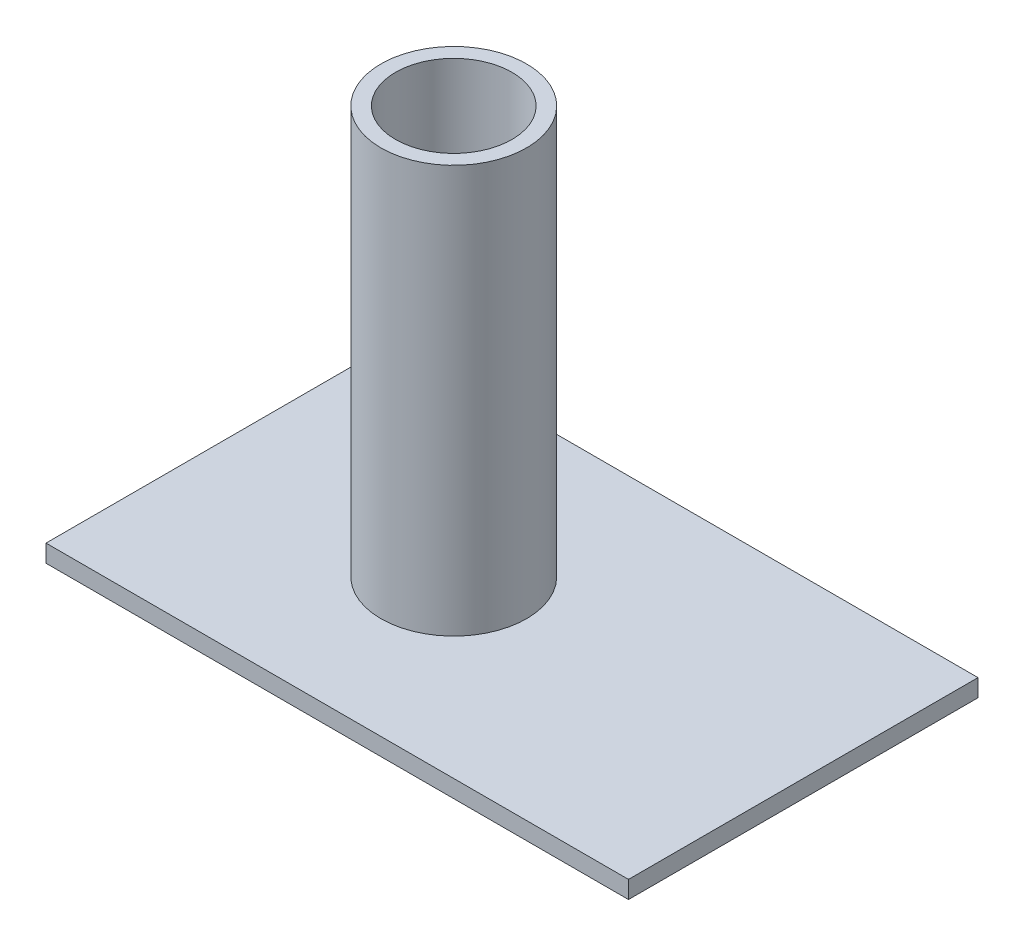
ISO-10303-21;
HEADER;
FILE_DESCRIPTION(('STEP AP214'),'2;1');
FILE_NAME('part.step','',(''),(''),'','','');
FILE_SCHEMA(('AUTOMOTIVE_DESIGN { 1 0 10303 214 1 1 1 1 }'));
ENDSEC;
DATA;
#1=APPLICATION_CONTEXT('core data for automotive mechanical design processes');
#2=APPLICATION_PROTOCOL_DEFINITION('international standard','automotive_design',2000,#1);
#3=PRODUCT_CONTEXT('',#1,'mechanical');
#4=PRODUCT('Part','Part','',(#3));
#5=PRODUCT_RELATED_PRODUCT_CATEGORY('part','',(#4));
#6=PRODUCT_DEFINITION_FORMATION('','',#4);
#7=PRODUCT_DEFINITION_CONTEXT('part definition',#1,'design');
#8=PRODUCT_DEFINITION('design','',#6,#7);
#9=PRODUCT_DEFINITION_SHAPE('','',#8);
#10=(LENGTH_UNIT() NAMED_UNIT(*) SI_UNIT(.MILLI.,.METRE.));
#11=(NAMED_UNIT(*) PLANE_ANGLE_UNIT() SI_UNIT($,.RADIAN.));
#12=(NAMED_UNIT(*) SI_UNIT($,.STERADIAN.) SOLID_ANGLE_UNIT());
#13=UNCERTAINTY_MEASURE_WITH_UNIT(LENGTH_MEASURE(1.E-05),#10,'distance_accuracy_value','');
#14=(GEOMETRIC_REPRESENTATION_CONTEXT(3) GLOBAL_UNCERTAINTY_ASSIGNED_CONTEXT((#13)) GLOBAL_UNIT_ASSIGNED_CONTEXT((#10,
#11,#12)) REPRESENTATION_CONTEXT('',''));
#15=CARTESIAN_POINT('',(0.,0.,0.));
#16=DIRECTION('',(0.,0.,1.));
#17=DIRECTION('',(1.,0.,0.));
#18=AXIS2_PLACEMENT_3D('',#15,#16,#17);
#19=CARTESIAN_POINT('',(0.,0.,0.));
#20=DIRECTION('',(0.,1.,0.));
#21=DIRECTION('',(0.,0.,1.));
#22=AXIS2_PLACEMENT_3D('',#19,#20,#21);
#23=PLANE('',#22);
#24=DIRECTION('',(0.,0.,1.));
#25=VECTOR('',#24,1.);
#26=CARTESIAN_POINT('',(-50.,0.,-30.));
#27=LINE('',#26,#25);
#28=CARTESIAN_POINT('',(-50.,0.,-30.));
#29=VERTEX_POINT('',#28);
#30=CARTESIAN_POINT('',(-50.,0.,30.));
#31=VERTEX_POINT('',#30);
#32=EDGE_CURVE('E102',#29,#31,#27,.T.);
#33=ORIENTED_EDGE('',*,*,#32,.T.);
#34=DIRECTION('',(1.,0.,0.));
#35=VECTOR('',#34,1.);
#36=CARTESIAN_POINT('',(-50.,0.,30.));
#37=LINE('',#36,#35);
#38=CARTESIAN_POINT('',(50.,0.,30.));
#39=VERTEX_POINT('',#38);
#40=EDGE_CURVE('E105',#31,#39,#37,.T.);
#41=ORIENTED_EDGE('',*,*,#40,.T.);
#42=DIRECTION('',(0.,0.,1.));
#43=VECTOR('',#42,1.);
#44=CARTESIAN_POINT('',(50.,0.,-30.));
#45=LINE('',#44,#43);
#46=CARTESIAN_POINT('',(50.,0.,-30.));
#47=VERTEX_POINT('',#46);
#48=EDGE_CURVE('E91',#47,#39,#45,.T.);
#49=ORIENTED_EDGE('',*,*,#48,.F.);
#50=DIRECTION('',(1.,0.,0.));
#51=VECTOR('',#50,1.);
#52=CARTESIAN_POINT('',(-50.,0.,-30.));
#53=LINE('',#52,#51);
#54=EDGE_CURVE('E66',#29,#47,#53,.T.);
#55=ORIENTED_EDGE('',*,*,#54,.F.);
#56=EDGE_LOOP('',(#33,#41,#49,#55));
#57=FACE_BOUND('',#56,.T.);
#58=CARTESIAN_POINT('',(-9.99999999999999,0.,0.));
#59=DIRECTION('',(0.,1.,0.));
#60=DIRECTION('',(0.,0.,1.));
#61=AXIS2_PLACEMENT_3D('',#58,#59,#60);
#62=CIRCLE('',#61,12.5);
#63=CARTESIAN_POINT('',(-9.99999999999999,0.,12.5));
#64=VERTEX_POINT('',#63);
#65=EDGE_CURVE('E118',#64,#64,#62,.T.);
#66=ORIENTED_EDGE('',*,*,#65,.F.);
#67=EDGE_LOOP('',(#66));
#68=FACE_BOUND('',#67,.T.);
#69=ADVANCED_FACE('F33',(#57,#68),#23,.T.);
#70=CARTESIAN_POINT('',(-50.,-3.,-30.));
#71=DIRECTION('',(-1.,0.,0.));
#72=DIRECTION('',(0.,0.,1.));
#73=AXIS2_PLACEMENT_3D('',#70,#71,#72);
#74=PLANE('',#73);
#75=ORIENTED_EDGE('',*,*,#32,.F.);
#76=DIRECTION('',(0.,1.,0.));
#77=VECTOR('',#76,1.);
#78=CARTESIAN_POINT('',(-50.,-3.,-30.));
#79=LINE('',#78,#77);
#80=CARTESIAN_POINT('',(-50.,-3.,-30.));
#81=VERTEX_POINT('',#80);
#82=EDGE_CURVE('E42',#81,#29,#79,.T.);
#83=ORIENTED_EDGE('',*,*,#82,.F.);
#84=DIRECTION('',(0.,0.,1.));
#85=VECTOR('',#84,1.);
#86=CARTESIAN_POINT('',(-50.,-3.,-30.));
#87=LINE('',#86,#85);
#88=CARTESIAN_POINT('',(-50.,-3.,30.));
#89=VERTEX_POINT('',#88);
#90=EDGE_CURVE('E96',#81,#89,#87,.T.);
#91=ORIENTED_EDGE('',*,*,#90,.T.);
#92=DIRECTION('',(0.,1.,0.));
#93=VECTOR('',#92,1.);
#94=CARTESIAN_POINT('',(-50.,-3.,30.));
#95=LINE('',#94,#93);
#96=EDGE_CURVE('E74',#89,#31,#95,.T.);
#97=ORIENTED_EDGE('',*,*,#96,.T.);
#98=EDGE_LOOP('',(#75,#83,#91,#97));
#99=FACE_BOUND('',#98,.T.);
#100=ADVANCED_FACE('F35',(#99),#74,.T.);
#101=CARTESIAN_POINT('',(-50.,-3.,-30.));
#102=DIRECTION('',(0.,0.,1.));
#103=DIRECTION('',(1.,0.,0.));
#104=AXIS2_PLACEMENT_3D('',#101,#102,#103);
#105=PLANE('',#104);
#106=ORIENTED_EDGE('',*,*,#54,.T.);
#107=DIRECTION('',(0.,1.,0.));
#108=VECTOR('',#107,1.);
#109=CARTESIAN_POINT('',(50.,-3.,-30.));
#110=LINE('',#109,#108);
#111=CARTESIAN_POINT('',(50.,-3.,-30.));
#112=VERTEX_POINT('',#111);
#113=EDGE_CURVE('E93',#112,#47,#110,.T.);
#114=ORIENTED_EDGE('',*,*,#113,.F.);
#115=DIRECTION('',(1.,0.,0.));
#116=VECTOR('',#115,1.);
#117=CARTESIAN_POINT('',(-50.,-3.,-30.));
#118=LINE('',#117,#116);
#119=EDGE_CURVE('E84',#81,#112,#118,.T.);
#120=ORIENTED_EDGE('',*,*,#119,.F.);
#121=ORIENTED_EDGE('',*,*,#82,.T.);
#122=EDGE_LOOP('',(#106,#114,#120,#121));
#123=FACE_BOUND('',#122,.T.);
#124=ADVANCED_FACE('F146',(#123),#105,.F.);
#125=CARTESIAN_POINT('',(50.,-3.,-30.));
#126=DIRECTION('',(-1.,0.,0.));
#127=DIRECTION('',(0.,0.,1.));
#128=AXIS2_PLACEMENT_3D('',#125,#126,#127);
#129=PLANE('',#128);
#130=ORIENTED_EDGE('',*,*,#48,.T.);
#131=DIRECTION('',(0.,1.,0.));
#132=VECTOR('',#131,1.);
#133=CARTESIAN_POINT('',(50.,-3.,30.));
#134=LINE('',#133,#132);
#135=CARTESIAN_POINT('',(50.,-3.,30.));
#136=VERTEX_POINT('',#135);
#137=EDGE_CURVE('E88',#136,#39,#134,.T.);
#138=ORIENTED_EDGE('',*,*,#137,.F.);
#139=DIRECTION('',(0.,0.,1.));
#140=VECTOR('',#139,1.);
#141=CARTESIAN_POINT('',(50.,-3.,-30.));
#142=LINE('',#141,#140);
#143=EDGE_CURVE('E79',#112,#136,#142,.T.);
#144=ORIENTED_EDGE('',*,*,#143,.F.);
#145=ORIENTED_EDGE('',*,*,#113,.T.);
#146=EDGE_LOOP('',(#130,#138,#144,#145));
#147=FACE_BOUND('',#146,.T.);
#148=ADVANCED_FACE('F89',(#147),#129,.F.);
#149=CARTESIAN_POINT('',(-50.,-3.,30.));
#150=DIRECTION('',(0.,0.,1.));
#151=DIRECTION('',(1.,0.,0.));
#152=AXIS2_PLACEMENT_3D('',#149,#150,#151);
#153=PLANE('',#152);
#154=ORIENTED_EDGE('',*,*,#40,.F.);
#155=ORIENTED_EDGE('',*,*,#96,.F.);
#156=DIRECTION('',(1.,0.,0.));
#157=VECTOR('',#156,1.);
#158=CARTESIAN_POINT('',(-50.,-3.,30.));
#159=LINE('',#158,#157);
#160=EDGE_CURVE('E83',#89,#136,#159,.T.);
#161=ORIENTED_EDGE('',*,*,#160,.T.);
#162=ORIENTED_EDGE('',*,*,#137,.T.);
#163=EDGE_LOOP('',(#154,#155,#161,#162));
#164=FACE_BOUND('',#163,.T.);
#165=ADVANCED_FACE('F95',(#164),#153,.T.);
#166=CARTESIAN_POINT('',(0.,-3.,0.));
#167=DIRECTION('',(0.,1.,0.));
#168=DIRECTION('',(0.,0.,1.));
#169=AXIS2_PLACEMENT_3D('',#166,#167,#168);
#170=PLANE('',#169);
#171=ORIENTED_EDGE('',*,*,#90,.F.);
#172=ORIENTED_EDGE('',*,*,#119,.T.);
#173=ORIENTED_EDGE('',*,*,#143,.T.);
#174=ORIENTED_EDGE('',*,*,#160,.F.);
#175=EDGE_LOOP('',(#171,#172,#173,#174));
#176=FACE_BOUND('',#175,.T.);
#177=ADVANCED_FACE('F82',(#176),#170,.F.);
#178=CARTESIAN_POINT('',(-9.99999999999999,70.,0.));
#179=DIRECTION('',(0.,1.,0.));
#180=DIRECTION('',(0.,0.,1.));
#181=AXIS2_PLACEMENT_3D('',#178,#179,#180);
#182=PLANE('',#181);
#183=CARTESIAN_POINT('',(-9.99999999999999,70.,0.));
#184=DIRECTION('',(0.,1.,0.));
#185=DIRECTION('',(0.,0.,1.));
#186=AXIS2_PLACEMENT_3D('',#183,#184,#185);
#187=CIRCLE('',#186,12.5);
#188=CARTESIAN_POINT('',(-9.99999999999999,70.,12.5));
#189=VERTEX_POINT('',#188);
#190=EDGE_CURVE('E106',#189,#189,#187,.T.);
#191=ORIENTED_EDGE('',*,*,#190,.T.);
#192=EDGE_LOOP('',(#191));
#193=FACE_BOUND('',#192,.T.);
#194=CARTESIAN_POINT('',(-9.99999999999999,70.,0.));
#195=DIRECTION('',(0.,1.,0.));
#196=DIRECTION('',(0.,0.,1.));
#197=AXIS2_PLACEMENT_3D('',#194,#195,#196);
#198=CIRCLE('',#197,10.);
#199=CARTESIAN_POINT('',(-9.99999999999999,70.,10.));
#200=VERTEX_POINT('',#199);
#201=EDGE_CURVE('E120',#200,#200,#198,.T.);
#202=ORIENTED_EDGE('',*,*,#201,.F.);
#203=EDGE_LOOP('',(#202));
#204=FACE_BOUND('',#203,.T.);
#205=ADVANCED_FACE('F130',(#193,#204),#182,.T.);
#206=CARTESIAN_POINT('',(-9.99999999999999,70.,0.));
#207=DIRECTION('',(0.,-1.,0.));
#208=DIRECTION('',(0.,0.,-1.));
#209=AXIS2_PLACEMENT_3D('',#206,#207,#208);
#210=CYLINDRICAL_SURFACE('',#209,12.5);
#211=ORIENTED_EDGE('',*,*,#190,.F.);
#212=EDGE_LOOP('',(#211));
#213=FACE_BOUND('',#212,.T.);
#214=ORIENTED_EDGE('',*,*,#65,.T.);
#215=EDGE_LOOP('',(#214));
#216=FACE_BOUND('',#215,.T.);
#217=ADVANCED_FACE('F132',(#213,#216),#210,.T.);
#218=CARTESIAN_POINT('',(-9.99999999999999,70.,0.));
#219=DIRECTION('',(0.,-1.,0.));
#220=DIRECTION('',(0.,0.,-1.));
#221=AXIS2_PLACEMENT_3D('',#218,#219,#220);
#222=CYLINDRICAL_SURFACE('',#221,10.);
#223=ORIENTED_EDGE('',*,*,#201,.T.);
#224=EDGE_LOOP('',(#223));
#225=FACE_BOUND('',#224,.T.);
#226=CARTESIAN_POINT('',(-9.99999999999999,0.,0.));
#227=DIRECTION('',(0.,1.,0.));
#228=DIRECTION('',(0.,0.,1.));
#229=AXIS2_PLACEMENT_3D('',#226,#227,#228);
#230=CIRCLE('',#229,10.);
#231=CARTESIAN_POINT('',(-9.99999999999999,0.,10.));
#232=VERTEX_POINT('',#231);
#233=EDGE_CURVE('E11',#232,#232,#230,.F.);
#234=ORIENTED_EDGE('',*,*,#233,.T.);
#235=EDGE_LOOP('',(#234));
#236=FACE_BOUND('',#235,.T.);
#237=ADVANCED_FACE('F127',(#225,#236),#222,.F.);
#238=ORIENTED_EDGE('',*,*,#233,.F.);
#239=EDGE_LOOP('',(#238));
#240=FACE_BOUND('',#239,.T.);
#241=ADVANCED_FACE('F115',(#240),#23,.T.);
#242=CLOSED_SHELL('',(#69,#100,#124,#148,#165,#177,#205,#217,#237,#241));
#243=MANIFOLD_SOLID_BREP('B2',#242);
#244=ADVANCED_BREP_SHAPE_REPRESENTATION('',(#18,#243),#14);
#245=SHAPE_DEFINITION_REPRESENTATION(#9,#244);
ENDSEC;
END-ISO-10303-21;
